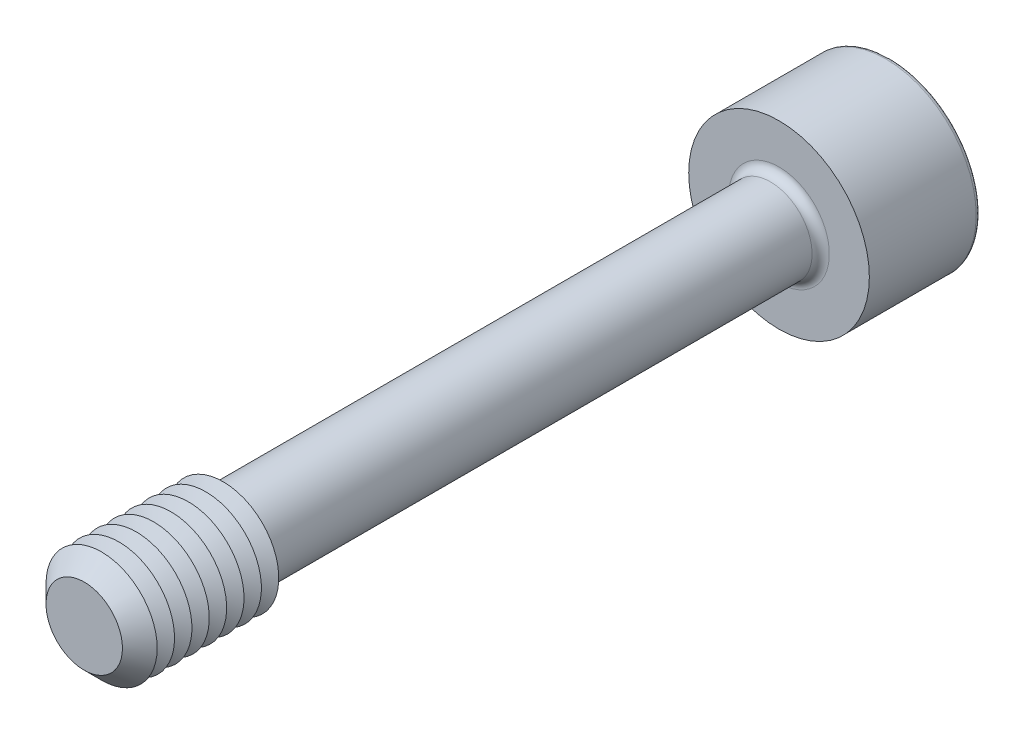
from build123d import *

# Parameters (mm, degrees)
SKETCH1_R       = 3
EXTRUDE1_DEPTH  = 25
CHAMFER1_SIZE   = 1.25
SKETCH3_R       = 6.5
EXTRUDE2_DEPTH  = 8
EXTRUDE3_DEPTH  = 6
FILLET1_R       = 0.62
FILLET2_R       = 0.31
LPATTERN1_COUNT = 7
LPATTERN1_PITCH = 1.25


with BuildPart() as part:
    # Sketch1 → Extrude1 (new, symmetric)
    with BuildSketch(Plane.XY):
        Circle(SKETCH1_R)
    extrude(amount=EXTRUDE1_DEPTH, both=True)

    # Sketch2 → Revolve1 (revolve)
    with BuildSketch(Plane(origin=(0, 0, 0), x_dir=(0, 0, -1), z_dir=(1, 0, 0))):
        Polygon((-25, 0), (-25, 4), (-15, 4), (-14.422649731, 3), (-14.422649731, 0), align=None)
    revolve(axis=Axis((0, 0, 14.422649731), (0, 0, 1)))

    # Chamfer1
    chamfer1_edges = [part.edges().sort_by_distance(p)[0] for p in [
        (0, -4, 25),
    ]]
    chamfer(chamfer1_edges, length=CHAMFER1_SIZE)

    # Sketch3 → Extrude2 (add)
    with BuildSketch(Plane(origin=(0, 0, -25), x_dir=(-1, 0, 0), z_dir=(0, 0, -1))):
        Circle(SKETCH3_R)
    extrude(amount=EXTRUDE2_DEPTH)

    # Sketch4 → Extrude3 (cut)
    with BuildSketch(Plane(origin=(-13.7, 0, -33), x_dir=(1, 0, 0), z_dir=(0, 0, 1))):
        Polygon((11.967949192, -3), (15.432050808, -3), (17.164101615, 0), (15.432050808, 3), (11.967949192, 3), (10.235898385, 0), align=None)
    extrude(amount=EXTRUDE3_DEPTH, mode=Mode.SUBTRACT)

    # Fillet1
    fillet1_edges = [part.edges().sort_by_distance(p)[0] for p in [
        (-3, 0, -25),
    ]]
    fillet(fillet1_edges, radius=FILLET1_R)

    # Fillet2
    fillet2_edges = [part.edges().sort_by_distance(p)[0] for p in [
        (6.5, 0, -33),
    ]]
    fillet(fillet2_edges, radius=FILLET2_R)

    # Sketch5 → Cut-Revolve1 (revolve, cut)
    with BuildSketch(Plane(origin=(0, 0, 0), x_dir=(0, 0, -1), z_dir=(1, 0, 0)), mode=Mode.PRIVATE) as cut_revolve1_sk:
        Polygon((27, 0), (27, -3), (25.267949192, 0), align=None)
    revolve(cut_revolve1_sk.sketch.rotate(Axis((0, 0, -25.267949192), (0, 0, -1)), 90), axis=Axis((0, 0, -25.267949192), (0, 0, -1)), mode=Mode.SUBTRACT)

    # Sketch7 → Cut-Revolve2 (revolve, cut)
    with BuildSketch(Plane(origin=(0, 0, 0), x_dir=(0, 0, -1), z_dir=(1, 0, 0)), mode=Mode.PRIVATE) as cut_revolve2_sk:
        Polygon((-15, 4), (-15.625, 2.917468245), (-16.25, 4), align=None)
    cut_revolve2 = revolve(cut_revolve2_sk.sketch.rotate(Axis((0, 0, -1.332048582), (0, 0, 1)), 90), axis=Axis((0, 0, -1.332048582), (0, 0, 1)), mode=Mode.SUBTRACT)

    # LPattern1: Cut-Revolve2 ×7
    with Locations(*[(0, 0, i * LPATTERN1_PITCH) for i in range(1, LPATTERN1_COUNT)]):
        add(cut_revolve2, mode=Mode.SUBTRACT)


solid = part.part
